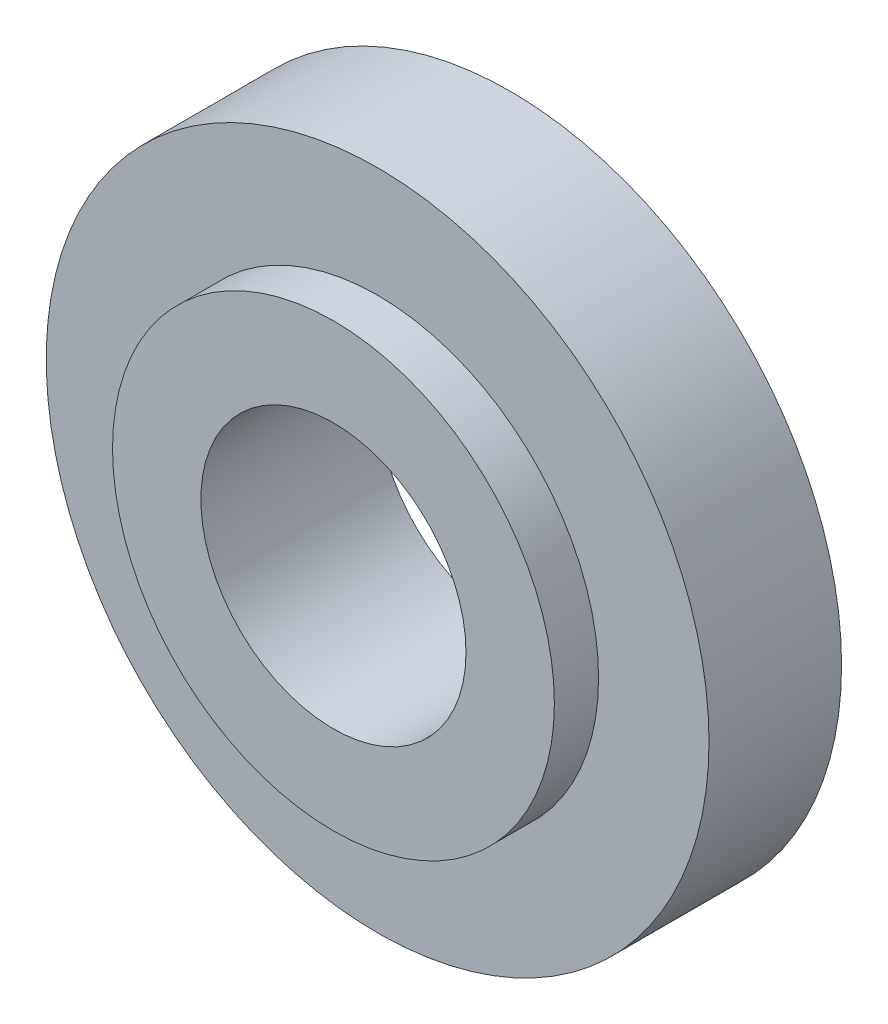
from build123d import *

# Parameters (mm, degrees)
ESQUISSE1_R             = 3.75
BOSS_EXTRU_1_DEPTH      = 1.5
ESQUISSE2_R             = 1.5
ENL_V_MAT_EXTRU_1_DEPTH = 6.511351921
BOSS_EXTRU_3_START      = 0.5
ESQUISSE4_R             = 2.5
ESQUISSE4_R_2           = 1.5
BOSS_EXTRU_3_DEPTH      = 0.5


with BuildPart() as part:
    # Esquisse1 → Boss.-Extru.1 (new body)
    with BuildSketch(Plane.XY):
        Circle(ESQUISSE1_R)
    extrude(amount=BOSS_EXTRU_1_DEPTH)

    # Esquisse2 → Enl_v. mat.-Extru.1 (cut, through all)
    with BuildSketch(Plane.XY.offset(1.5)):
        Circle(ESQUISSE2_R)
    extrude(amount=-ENL_V_MAT_EXTRU_1_DEPTH, mode=Mode.SUBTRACT)

    # Esquisse4 → Boss.-Extru.3 (add)
    with BuildSketch(Plane.XY.offset(1.5).offset(BOSS_EXTRU_3_START)):
        Circle(ESQUISSE4_R)
        Circle(ESQUISSE4_R_2, mode=Mode.SUBTRACT)
    extrude(amount=-BOSS_EXTRU_3_DEPTH)


solid = part.part
